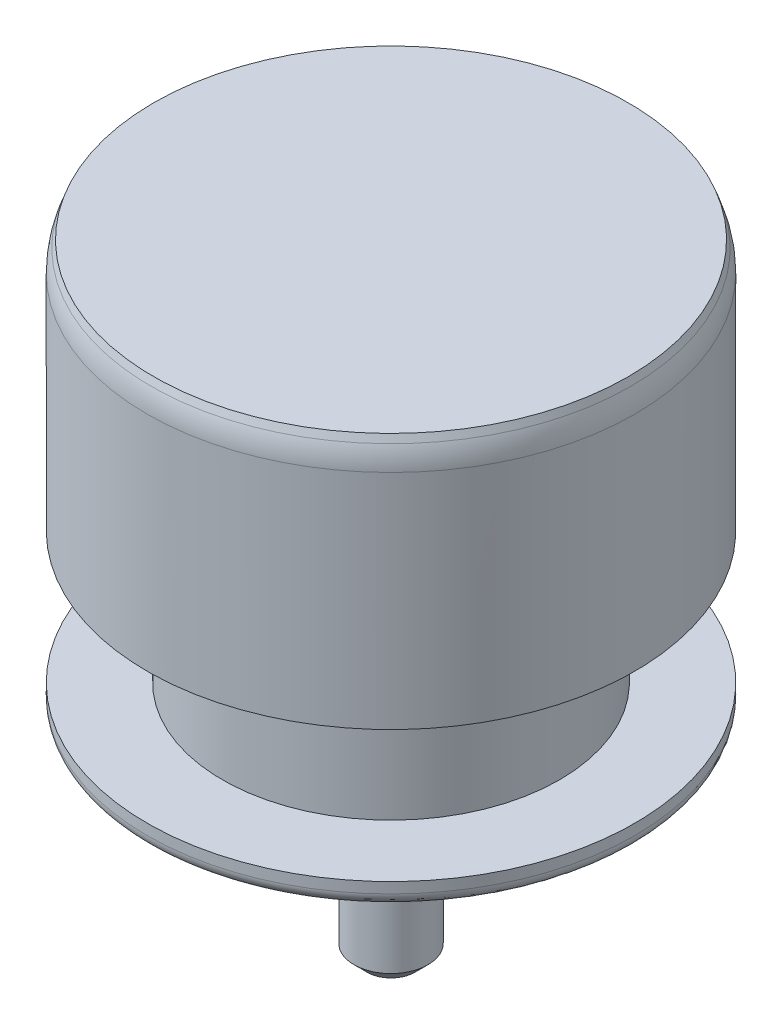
from build123d import *

# Parameters (mm, degrees)
FILLET1_R     = 0.2
FILLET2_R     = 1
CHAMFER1_SIZE = 0.2


with BuildPart() as part:
    # Sketch1 → Revolve1 (revolve)
    with BuildSketch(Plane.XY, mode=Mode.PRIVATE) as revolve1_sk:
        Polygon((0, 0), (0, -9.6), (0.57, -9.6), (0.57, -7.896925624), (3.76, -6.200772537), (3.76, -5.915), (2.6, -5.915), (2.6, -3.885), (3.76, -3.885), (3.76, -0.274747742), (3.66, 0), align=None)
    revolve(revolve1_sk.sketch.rotate(Axis((0, 0, 0), (0, -1, 0)), 180), axis=Axis((0, 0, 0), (0, -1, 0)))

    # Fillet1
    fillet1_edges = [part.edges().sort_by_distance(p)[0] for p in [
        (3.76, -6.200772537, 0),
    ]]
    fillet(fillet1_edges, radius=FILLET1_R)

    # Fillet2
    fillet2_edges = [part.edges().sort_by_distance(p)[0] for p in [
        (3.76, -0.274747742, 0),
    ]]
    fillet(fillet2_edges, radius=FILLET2_R)

    # Chamfer1
    chamfer1_edges = [part.edges().sort_by_distance(p)[0] for p in [
        (0.57, -9.6, 0),
    ]]
    chamfer(chamfer1_edges, length=CHAMFER1_SIZE)


solid = part.part
